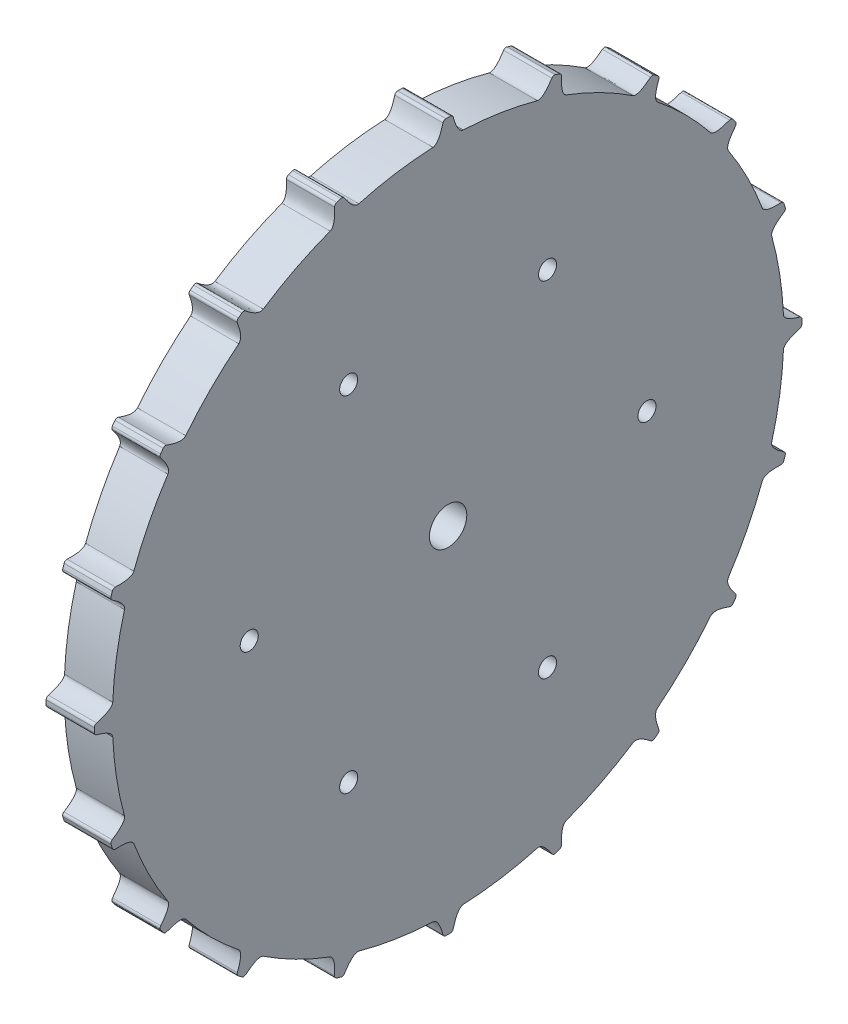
from build123d import *

# Parameters (mm, degrees)
ESQUISSE1_R        = 1.5
ESQUISSE1_R_2      = 3.1
BOSS_EXTRU_1_DEPTH = 8


with BuildPart() as part:
    # Esquisse1 → Boss.-Extru.1 (new body)
    with BuildSketch(Plane(origin=(0, 0, 0), x_dir=(0, 0, -1), z_dir=(1, 0, 0))):
        with BuildLine():
            ThreePointArc((-2.506994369, 55.648557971), (-8.714181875, 55.019179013), (-14.812056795, 53.699627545))
            add(Edge.make_bspline(
                [(-17.223005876, 55.740828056), (-16.734744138, 54.994389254), (-15.844657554, 53.907750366), (-15.127444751, 53.633588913), (-14.812056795, 53.699627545)],
                knots=[0.061335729, 0.061335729, 0.061335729, 0.061335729, 0.509140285, 0.956944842, 0.956944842, 0.956944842, 0.956944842], degree=3))
            ThreePointArc((-17.223005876, 55.740828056), (-17.473847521, 55.938199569), (-17.792983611, 55.943603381))
            ThreePointArc((-17.792983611, 55.943603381), (-18.140842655, 55.831772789), (-18.487998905, 55.717779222))
            ThreePointArc((-18.487998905, 55.717779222), (-18.743009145, 55.525823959), (-18.829932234, 55.218706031))
            add(Edge.make_bspline(
                [(-18.829932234, 55.218706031), (-18.786198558, 54.327831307), (-18.867583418, 52.925542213), (-19.286672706, 52.28217383), (-19.580643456, 52.150219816)],
                knots=[0.061335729, 0.061335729, 0.061335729, 0.061335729, 0.509140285, 0.956944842, 0.956944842, 0.956944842, 0.956944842], degree=3))
            ThreePointArc((-19.580643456, 52.150219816), (-25.289540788, 49.63351843), (-30.681200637, 46.494203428))
            add(Edge.make_bspline(
                [(-33.604915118, 47.690476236), (-32.909888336, 47.131451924), (-31.727575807, 46.37304881), (-30.960745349, 46.333936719), (-30.681200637, 46.494203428)],
                knots=[0.061335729, 0.061335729, 0.061335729, 0.061335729, 0.509140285, 0.956944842, 0.956944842, 0.956944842, 0.956944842], degree=3))
            ThreePointArc((-33.604915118, 47.690476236), (-33.904470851, 47.800673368), (-34.209657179, 47.707194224))
            ThreePointArc((-34.209657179, 47.707194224), (-34.505933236, 47.493342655), (-34.800872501, 47.277651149))
            ThreePointArc((-34.800872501, 47.277651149), (-34.984084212, 47.016288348), (-34.971848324, 46.697341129))
            add(Edge.make_bspline(
                [(-34.971848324, 46.697341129), (-34.654959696, 45.863583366), (-34.299030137, 44.504777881), (-34.498795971, 43.763392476), (-34.737602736, 43.547054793)],
                knots=[0.061335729, 0.061335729, 0.061335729, 0.061335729, 0.509140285, 0.956944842, 0.956944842, 0.956944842, 0.956944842], degree=3))
            ThreePointArc((-34.737602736, 43.547054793), (-39.389383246, 39.389383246), (-43.547054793, 34.737602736))
            add(Edge.make_bspline(
                [(-46.697341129, 34.971848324), (-45.863583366, 34.654959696), (-44.504777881, 34.299030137), (-43.763392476, 34.498795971), (-43.547054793, 34.737602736)],
                knots=[0.061335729, 0.061335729, 0.061335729, 0.061335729, 0.509140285, 0.956944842, 0.956944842, 0.956944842, 0.956944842], degree=3))
            ThreePointArc((-46.697341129, 34.971848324), (-47.016288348, 34.984084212), (-47.277651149, 34.800872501))
            ThreePointArc((-47.277651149, 34.800872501), (-47.493342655, 34.505933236), (-47.707194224, 34.209657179))
            ThreePointArc((-47.707194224, 34.209657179), (-47.800673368, 33.904470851), (-47.690476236, 33.604915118))
            add(Edge.make_bspline(
                [(-47.690476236, 33.604915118), (-47.131451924, 32.909888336), (-46.37304881, 31.727575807), (-46.333936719, 30.960745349), (-46.494203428, 30.681200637)],
                knots=[0.061335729, 0.061335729, 0.061335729, 0.061335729, 0.509140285, 0.956944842, 0.956944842, 0.956944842, 0.956944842], degree=3))
            ThreePointArc((-46.494203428, 30.681200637), (-49.63351843, 25.289540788), (-52.150219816, 19.580643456))
            add(Edge.make_bspline(
                [(-55.218706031, 18.829932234), (-54.327831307, 18.786198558), (-52.925542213, 18.867583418), (-52.28217383, 19.286672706), (-52.150219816, 19.580643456)],
                knots=[0.061335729, 0.061335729, 0.061335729, 0.061335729, 0.509140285, 0.956944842, 0.956944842, 0.956944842, 0.956944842], degree=3))
            ThreePointArc((-55.218706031, 18.829932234), (-55.525823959, 18.743009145), (-55.717779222, 18.487998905))
            ThreePointArc((-55.717779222, 18.487998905), (-55.831772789, 18.140842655), (-55.943603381, 17.792983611))
            ThreePointArc((-55.943603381, 17.792983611), (-55.938199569, 17.473847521), (-55.740828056, 17.223005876))
            add(Edge.make_bspline(
                [(-55.740828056, 17.223005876), (-54.994389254, 16.734744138), (-53.907750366, 15.844657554), (-53.633588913, 15.127444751), (-53.699627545, 14.812056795)],
                knots=[0.061335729, 0.061335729, 0.061335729, 0.061335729, 0.509140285, 0.956944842, 0.956944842, 0.956944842, 0.956944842], degree=3))
            ThreePointArc((-53.699627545, 14.812056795), (-55.019179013, 8.714181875), (-55.648557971, 2.506994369))
            add(Edge.make_bspline(
                [(-58.334879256, 0.844811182), (-57.474092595, 1.078513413), (-56.165585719, 1.589246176), (-55.683211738, 2.186635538), (-55.648557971, 2.506994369)],
                knots=[0.061335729, 0.061335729, 0.061335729, 0.061335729, 0.509140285, 0.956944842, 0.956944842, 0.956944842, 0.956944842], degree=3))
            ThreePointArc((-58.334879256, 0.844811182), (-58.600105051, 0.667237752), (-58.703862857, 0.365391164))
            ThreePointArc((-58.703862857, 0.365391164), (-58.705, 0), (-58.703862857, -0.365391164))
            ThreePointArc((-58.703862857, -0.365391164), (-58.600105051, -0.667237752), (-58.334879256, -0.844811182))
            add(Edge.make_bspline(
                [(-58.334879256, -0.844811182), (-57.474092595, -1.078513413), (-56.165585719, -1.589246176), (-55.683211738, -2.186635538), (-55.648557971, -2.506994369)],
                knots=[0.061335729, 0.061335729, 0.061335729, 0.061335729, 0.509140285, 0.956944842, 0.956944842, 0.956944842, 0.956944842], degree=3))
            ThreePointArc((-55.648557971, -2.506994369), (-55.019179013, -8.714181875), (-53.699627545, -14.812056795))
            add(Edge.make_bspline(
                [(-55.740828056, -17.223005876), (-54.994389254, -16.734744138), (-53.907750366, -15.844657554), (-53.633588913, -15.127444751), (-53.699627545, -14.812056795)],
                knots=[0.061335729, 0.061335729, 0.061335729, 0.061335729, 0.509140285, 0.956944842, 0.956944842, 0.956944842, 0.956944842], degree=3))
            ThreePointArc((-55.740828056, -17.223005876), (-55.938199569, -17.473847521), (-55.943603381, -17.792983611))
            ThreePointArc((-55.943603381, -17.792983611), (-55.831772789, -18.140842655), (-55.717779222, -18.487998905))
            ThreePointArc((-55.717779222, -18.487998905), (-55.525823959, -18.743009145), (-55.218706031, -18.829932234))
            add(Edge.make_bspline(
                [(-55.218706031, -18.829932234), (-54.327831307, -18.786198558), (-52.925542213, -18.867583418), (-52.28217383, -19.286672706), (-52.150219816, -19.580643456)],
                knots=[0.061335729, 0.061335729, 0.061335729, 0.061335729, 0.509140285, 0.956944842, 0.956944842, 0.956944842, 0.956944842], degree=3))
            ThreePointArc((-52.150219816, -19.580643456), (-49.63351843, -25.289540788), (-46.494203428, -30.681200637))
            add(Edge.make_bspline(
                [(-47.690476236, -33.604915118), (-47.131451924, -32.909888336), (-46.37304881, -31.727575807), (-46.333936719, -30.960745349), (-46.494203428, -30.681200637)],
                knots=[0.061335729, 0.061335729, 0.061335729, 0.061335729, 0.509140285, 0.956944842, 0.956944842, 0.956944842, 0.956944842], degree=3))
            ThreePointArc((-47.690476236, -33.604915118), (-47.800673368, -33.904470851), (-47.707194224, -34.209657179))
            ThreePointArc((-47.707194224, -34.209657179), (-47.493342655, -34.505933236), (-47.277651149, -34.800872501))
            ThreePointArc((-47.277651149, -34.800872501), (-47.016288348, -34.984084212), (-46.697341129, -34.971848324))
            add(Edge.make_bspline(
                [(-46.697341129, -34.971848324), (-45.863583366, -34.654959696), (-44.504777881, -34.299030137), (-43.763392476, -34.498795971), (-43.547054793, -34.737602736)],
                knots=[0.061335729, 0.061335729, 0.061335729, 0.061335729, 0.509140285, 0.956944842, 0.956944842, 0.956944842, 0.956944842], degree=3))
            ThreePointArc((-43.547054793, -34.737602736), (-39.389383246, -39.389383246), (-34.737602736, -43.547054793))
            add(Edge.make_bspline(
                [(-34.971848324, -46.697341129), (-34.654959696, -45.863583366), (-34.299030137, -44.504777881), (-34.498795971, -43.763392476), (-34.737602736, -43.547054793)],
                knots=[0.061335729, 0.061335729, 0.061335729, 0.061335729, 0.509140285, 0.956944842, 0.956944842, 0.956944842, 0.956944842], degree=3))
            ThreePointArc((-34.971848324, -46.697341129), (-34.984084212, -47.016288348), (-34.800872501, -47.277651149))
            ThreePointArc((-34.800872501, -47.277651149), (-34.505933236, -47.493342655), (-34.209657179, -47.707194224))
            ThreePointArc((-34.209657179, -47.707194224), (-33.904470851, -47.800673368), (-33.604915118, -47.690476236))
            add(Edge.make_bspline(
                [(-33.604915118, -47.690476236), (-32.909888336, -47.131451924), (-31.727575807, -46.37304881), (-30.960745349, -46.333936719), (-30.681200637, -46.494203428)],
                knots=[0.061335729, 0.061335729, 0.061335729, 0.061335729, 0.509140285, 0.956944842, 0.956944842, 0.956944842, 0.956944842], degree=3))
            ThreePointArc((-30.681200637, -46.494203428), (-25.289540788, -49.63351843), (-19.580643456, -52.150219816))
            add(Edge.make_bspline(
                [(-18.829932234, -55.218706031), (-18.786198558, -54.327831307), (-18.867583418, -52.925542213), (-19.286672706, -52.28217383), (-19.580643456, -52.150219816)],
                knots=[0.061335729, 0.061335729, 0.061335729, 0.061335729, 0.509140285, 0.956944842, 0.956944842, 0.956944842, 0.956944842], degree=3))
            ThreePointArc((-18.829932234, -55.218706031), (-18.743009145, -55.525823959), (-18.487998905, -55.717779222))
            ThreePointArc((-18.487998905, -55.717779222), (-18.140842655, -55.831772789), (-17.792983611, -55.943603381))
            ThreePointArc((-17.792983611, -55.943603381), (-17.473847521, -55.938199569), (-17.223005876, -55.740828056))
            add(Edge.make_bspline(
                [(-17.223005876, -55.740828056), (-16.734744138, -54.994389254), (-15.844657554, -53.907750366), (-15.127444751, -53.633588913), (-14.812056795, -53.699627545)],
                knots=[0.061335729, 0.061335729, 0.061335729, 0.061335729, 0.509140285, 0.956944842, 0.956944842, 0.956944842, 0.956944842], degree=3))
            ThreePointArc((-14.812056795, -53.699627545), (-8.714181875, -55.019179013), (-2.506994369, -55.648557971))
            add(Edge.make_bspline(
                [(-0.844811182, -58.334879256), (-1.078513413, -57.474092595), (-1.589246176, -56.165585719), (-2.186635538, -55.683211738), (-2.506994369, -55.648557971)],
                knots=[0.061335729, 0.061335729, 0.061335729, 0.061335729, 0.509140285, 0.956944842, 0.956944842, 0.956944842, 0.956944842], degree=3))
            ThreePointArc((-0.844811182, -58.334879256), (-0.667237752, -58.600105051), (-0.365391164, -58.703862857))
            ThreePointArc((-0.365391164, -58.703862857), (0, -58.705), (0.365391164, -58.703862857))
            ThreePointArc((0.365391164, -58.703862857), (0.667237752, -58.600105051), (0.844811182, -58.334879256))
            add(Edge.make_bspline(
                [(0.844811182, -58.334879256), (1.078513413, -57.474092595), (1.589246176, -56.165585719), (2.186635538, -55.683211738), (2.506994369, -55.648557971)],
                knots=[0.061335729, 0.061335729, 0.061335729, 0.061335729, 0.509140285, 0.956944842, 0.956944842, 0.956944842, 0.956944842], degree=3))
            ThreePointArc((2.506994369, -55.648557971), (8.714181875, -55.019179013), (14.812056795, -53.699627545))
            add(Edge.make_bspline(
                [(17.223005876, -55.740828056), (16.734744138, -54.994389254), (15.844657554, -53.907750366), (15.127444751, -53.633588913), (14.812056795, -53.699627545)],
                knots=[0.061335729, 0.061335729, 0.061335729, 0.061335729, 0.509140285, 0.956944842, 0.956944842, 0.956944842, 0.956944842], degree=3))
            ThreePointArc((17.223005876, -55.740828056), (17.473847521, -55.938199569), (17.792983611, -55.943603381))
            ThreePointArc((17.792983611, -55.943603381), (18.140842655, -55.831772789), (18.487998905, -55.717779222))
            ThreePointArc((18.487998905, -55.717779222), (18.743009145, -55.525823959), (18.829932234, -55.218706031))
            add(Edge.make_bspline(
                [(18.829932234, -55.218706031), (18.786198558, -54.327831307), (18.867583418, -52.925542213), (19.286672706, -52.28217383), (19.580643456, -52.150219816)],
                knots=[0.061335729, 0.061335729, 0.061335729, 0.061335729, 0.509140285, 0.956944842, 0.956944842, 0.956944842, 0.956944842], degree=3))
            ThreePointArc((19.580643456, -52.150219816), (25.289540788, -49.63351843), (30.681200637, -46.494203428))
            add(Edge.make_bspline(
                [(33.604915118, -47.690476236), (32.909888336, -47.131451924), (31.727575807, -46.37304881), (30.960745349, -46.333936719), (30.681200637, -46.494203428)],
                knots=[0.061335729, 0.061335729, 0.061335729, 0.061335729, 0.509140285, 0.956944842, 0.956944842, 0.956944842, 0.956944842], degree=3))
            ThreePointArc((33.604915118, -47.690476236), (33.904470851, -47.800673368), (34.209657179, -47.707194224))
            ThreePointArc((34.209657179, -47.707194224), (34.505933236, -47.493342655), (34.800872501, -47.277651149))
            ThreePointArc((34.800872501, -47.277651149), (34.984084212, -47.016288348), (34.971848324, -46.697341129))
            add(Edge.make_bspline(
                [(34.971848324, -46.697341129), (34.654959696, -45.863583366), (34.299030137, -44.504777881), (34.498795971, -43.763392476), (34.737602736, -43.547054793)],
                knots=[0.061335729, 0.061335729, 0.061335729, 0.061335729, 0.509140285, 0.956944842, 0.956944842, 0.956944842, 0.956944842], degree=3))
            ThreePointArc((34.737602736, -43.547054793), (39.389383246, -39.389383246), (43.547054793, -34.737602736))
            add(Edge.make_bspline(
                [(46.697341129, -34.971848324), (45.863583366, -34.654959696), (44.504777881, -34.299030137), (43.763392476, -34.498795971), (43.547054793, -34.737602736)],
                knots=[0.061335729, 0.061335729, 0.061335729, 0.061335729, 0.509140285, 0.956944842, 0.956944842, 0.956944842, 0.956944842], degree=3))
            ThreePointArc((46.697341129, -34.971848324), (47.016288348, -34.984084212), (47.277651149, -34.800872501))
            ThreePointArc((47.277651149, -34.800872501), (47.493342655, -34.505933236), (47.707194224, -34.209657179))
            ThreePointArc((47.707194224, -34.209657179), (47.800673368, -33.904470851), (47.690476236, -33.604915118))
            add(Edge.make_bspline(
                [(47.690476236, -33.604915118), (47.131451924, -32.909888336), (46.37304881, -31.727575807), (46.333936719, -30.960745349), (46.494203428, -30.681200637)],
                knots=[0.061335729, 0.061335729, 0.061335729, 0.061335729, 0.509140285, 0.956944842, 0.956944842, 0.956944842, 0.956944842], degree=3))
            ThreePointArc((46.494203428, -30.681200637), (49.63351843, -25.289540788), (52.150219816, -19.580643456))
            add(Edge.make_bspline(
                [(55.218706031, -18.829932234), (54.327831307, -18.786198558), (52.925542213, -18.867583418), (52.28217383, -19.286672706), (52.150219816, -19.580643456)],
                knots=[0.061335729, 0.061335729, 0.061335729, 0.061335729, 0.509140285, 0.956944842, 0.956944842, 0.956944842, 0.956944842], degree=3))
            ThreePointArc((55.218706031, -18.829932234), (55.525823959, -18.743009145), (55.717779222, -18.487998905))
            ThreePointArc((55.717779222, -18.487998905), (55.831772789, -18.140842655), (55.943603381, -17.792983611))
            ThreePointArc((55.943603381, -17.792983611), (55.938199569, -17.473847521), (55.740828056, -17.223005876))
            add(Edge.make_bspline(
                [(55.740828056, -17.223005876), (54.994389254, -16.734744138), (53.907750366, -15.844657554), (53.633588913, -15.127444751), (53.699627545, -14.812056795)],
                knots=[0.061335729, 0.061335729, 0.061335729, 0.061335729, 0.509140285, 0.956944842, 0.956944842, 0.956944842, 0.956944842], degree=3))
            ThreePointArc((53.699627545, -14.812056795), (55.019179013, -8.714181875), (55.648557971, -2.506994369))
            add(Edge.make_bspline(
                [(58.334879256, -0.844811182), (57.474092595, -1.078513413), (56.165585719, -1.589246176), (55.683211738, -2.186635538), (55.648557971, -2.506994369)],
                knots=[0.061335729, 0.061335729, 0.061335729, 0.061335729, 0.509140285, 0.956944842, 0.956944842, 0.956944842, 0.956944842], degree=3))
            ThreePointArc((58.334879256, -0.844811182), (58.600105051, -0.667237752), (58.703862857, -0.365391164))
            ThreePointArc((58.703862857, -0.365391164), (58.705, 0), (58.703862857, 0.365391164))
            ThreePointArc((58.703862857, 0.365391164), (58.600105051, 0.667237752), (58.334879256, 0.844811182))
            add(Edge.make_bspline(
                [(58.334879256, 0.844811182), (57.474092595, 1.078513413), (56.165585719, 1.589246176), (55.683211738, 2.186635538), (55.648557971, 2.506994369)],
                knots=[0.061335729, 0.061335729, 0.061335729, 0.061335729, 0.509140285, 0.956944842, 0.956944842, 0.956944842, 0.956944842], degree=3))
            ThreePointArc((55.648557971, 2.506994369), (55.019179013, 8.714181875), (53.699627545, 14.812056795))
            add(Edge.make_bspline(
                [(55.740828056, 17.223005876), (54.994389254, 16.734744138), (53.907750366, 15.844657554), (53.633588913, 15.127444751), (53.699627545, 14.812056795)],
                knots=[0.061335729, 0.061335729, 0.061335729, 0.061335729, 0.509140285, 0.956944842, 0.956944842, 0.956944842, 0.956944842], degree=3))
            ThreePointArc((55.740828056, 17.223005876), (55.938199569, 17.473847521), (55.943603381, 17.792983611))
            ThreePointArc((55.943603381, 17.792983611), (55.831772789, 18.140842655), (55.717779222, 18.487998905))
            ThreePointArc((55.717779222, 18.487998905), (55.525823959, 18.743009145), (55.218706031, 18.829932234))
            add(Edge.make_bspline(
                [(55.218706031, 18.829932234), (54.327831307, 18.786198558), (52.925542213, 18.867583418), (52.28217383, 19.286672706), (52.150219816, 19.580643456)],
                knots=[0.061335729, 0.061335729, 0.061335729, 0.061335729, 0.509140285, 0.956944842, 0.956944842, 0.956944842, 0.956944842], degree=3))
            ThreePointArc((52.150219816, 19.580643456), (49.63351843, 25.289540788), (46.494203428, 30.681200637))
            add(Edge.make_bspline(
                [(47.690476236, 33.604915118), (47.131451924, 32.909888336), (46.37304881, 31.727575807), (46.333936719, 30.960745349), (46.494203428, 30.681200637)],
                knots=[0.061335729, 0.061335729, 0.061335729, 0.061335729, 0.509140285, 0.956944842, 0.956944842, 0.956944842, 0.956944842], degree=3))
            ThreePointArc((47.690476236, 33.604915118), (47.800673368, 33.904470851), (47.707194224, 34.209657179))
            ThreePointArc((47.707194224, 34.209657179), (47.493342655, 34.505933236), (47.277651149, 34.800872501))
            ThreePointArc((47.277651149, 34.800872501), (47.016288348, 34.984084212), (46.697341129, 34.971848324))
            add(Edge.make_bspline(
                [(46.697341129, 34.971848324), (45.863583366, 34.654959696), (44.504777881, 34.299030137), (43.763392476, 34.498795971), (43.547054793, 34.737602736)],
                knots=[0.061335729, 0.061335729, 0.061335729, 0.061335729, 0.509140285, 0.956944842, 0.956944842, 0.956944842, 0.956944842], degree=3))
            ThreePointArc((43.547054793, 34.737602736), (39.389383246, 39.389383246), (34.737602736, 43.547054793))
            add(Edge.make_bspline(
                [(34.971848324, 46.697341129), (34.654959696, 45.863583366), (34.299030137, 44.504777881), (34.498795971, 43.763392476), (34.737602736, 43.547054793)],
                knots=[0.061335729, 0.061335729, 0.061335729, 0.061335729, 0.509140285, 0.956944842, 0.956944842, 0.956944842, 0.956944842], degree=3))
            ThreePointArc((34.971848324, 46.697341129), (34.984084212, 47.016288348), (34.800872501, 47.277651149))
            ThreePointArc((34.800872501, 47.277651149), (34.505933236, 47.493342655), (34.209657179, 47.707194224))
            ThreePointArc((34.209657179, 47.707194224), (33.904470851, 47.800673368), (33.604915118, 47.690476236))
            add(Edge.make_bspline(
                [(33.604915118, 47.690476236), (32.909888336, 47.131451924), (31.727575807, 46.37304881), (30.960745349, 46.333936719), (30.681200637, 46.494203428)],
                knots=[0.061335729, 0.061335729, 0.061335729, 0.061335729, 0.509140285, 0.956944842, 0.956944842, 0.956944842, 0.956944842], degree=3))
            ThreePointArc((30.681200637, 46.494203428), (25.289540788, 49.63351843), (19.580643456, 52.150219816))
            add(Edge.make_bspline(
                [(18.829932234, 55.218706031), (18.786198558, 54.327831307), (18.867583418, 52.925542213), (19.286672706, 52.28217383), (19.580643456, 52.150219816)],
                knots=[0.061335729, 0.061335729, 0.061335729, 0.061335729, 0.509140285, 0.956944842, 0.956944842, 0.956944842, 0.956944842], degree=3))
            ThreePointArc((18.829932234, 55.218706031), (18.743009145, 55.525823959), (18.487998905, 55.717779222))
            ThreePointArc((18.487998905, 55.717779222), (18.140842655, 55.831772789), (17.792983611, 55.943603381))
            ThreePointArc((17.792983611, 55.943603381), (17.473847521, 55.938199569), (17.223005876, 55.740828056))
            add(Edge.make_bspline(
                [(17.223005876, 55.740828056), (16.734744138, 54.994389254), (15.844657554, 53.907750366), (15.127444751, 53.633588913), (14.812056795, 53.699627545)],
                knots=[0.061335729, 0.061335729, 0.061335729, 0.061335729, 0.509140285, 0.956944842, 0.956944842, 0.956944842, 0.956944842], degree=3))
            ThreePointArc((14.812056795, 53.699627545), (8.714181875, 55.019179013), (2.506994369, 55.648557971))
            add(Edge.make_bspline(
                [(0.844811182, 58.334879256), (1.078513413, 57.474092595), (1.589246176, 56.165585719), (2.186635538, 55.683211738), (2.506994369, 55.648557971)],
                knots=[0.061335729, 0.061335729, 0.061335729, 0.061335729, 0.509140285, 0.956944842, 0.956944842, 0.956944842, 0.956944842], degree=3))
            ThreePointArc((0.844811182, 58.334879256), (0.667237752, 58.600105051), (0.365391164, 58.703862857))
            ThreePointArc((0.365391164, 58.703862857), (0, 58.705), (-0.365391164, 58.703862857))
            ThreePointArc((-0.365391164, 58.703862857), (-0.667237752, 58.600105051), (-0.844811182, 58.334879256))
            add(Edge.make_bspline(
                [(-0.844811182, 58.334879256), (-1.078513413, 57.474092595), (-1.589246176, 56.165585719), (-2.186635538, 55.683211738), (-2.506994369, 55.648557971)],
                knots=[0.061335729, 0.061335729, 0.061335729, 0.061335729, 0.509140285, 0.956944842, 0.956944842, 0.956944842, 0.956944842], degree=3))
        make_face()
        with Locations((33, 0)):
            Circle(ESQUISSE1_R, mode=Mode.SUBTRACT)
        with Locations((16.5, -28.578838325)):
            Circle(ESQUISSE1_R, mode=Mode.SUBTRACT)
        Circle(ESQUISSE1_R_2, mode=Mode.SUBTRACT)
        with Locations((-16.5, -28.578838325)):
            Circle(ESQUISSE1_R, mode=Mode.SUBTRACT)
        with Locations((-33, 0)):
            Circle(ESQUISSE1_R, mode=Mode.SUBTRACT)
        with Locations((-16.5, 28.578838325)):
            Circle(ESQUISSE1_R, mode=Mode.SUBTRACT)
        with Locations((16.5, 28.578838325)):
            Circle(ESQUISSE1_R, mode=Mode.SUBTRACT)
    extrude(amount=BOSS_EXTRU_1_DEPTH)


solid = part.part
